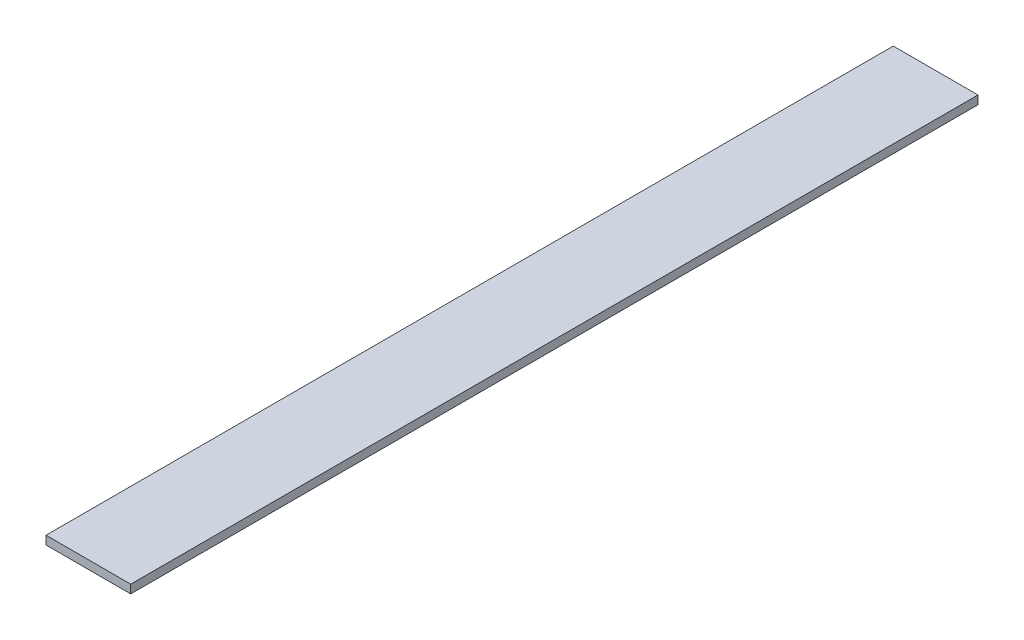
ISO-10303-21;
HEADER;
FILE_DESCRIPTION(('STEP AP214'),'2;1');
FILE_NAME('part.step','',(''),(''),'','','');
FILE_SCHEMA(('AUTOMOTIVE_DESIGN { 1 0 10303 214 1 1 1 1 }'));
ENDSEC;
DATA;
#1=APPLICATION_CONTEXT('core data for automotive mechanical design processes');
#2=APPLICATION_PROTOCOL_DEFINITION('international standard','automotive_design',2000,#1);
#3=PRODUCT_CONTEXT('',#1,'mechanical');
#4=PRODUCT('Part','Part','',(#3));
#5=PRODUCT_RELATED_PRODUCT_CATEGORY('part','',(#4));
#6=PRODUCT_DEFINITION_FORMATION('','',#4);
#7=PRODUCT_DEFINITION_CONTEXT('part definition',#1,'design');
#8=PRODUCT_DEFINITION('design','',#6,#7);
#9=PRODUCT_DEFINITION_SHAPE('','',#8);
#10=(LENGTH_UNIT() NAMED_UNIT(*) SI_UNIT(.MILLI.,.METRE.));
#11=(NAMED_UNIT(*) PLANE_ANGLE_UNIT() SI_UNIT($,.RADIAN.));
#12=(NAMED_UNIT(*) SI_UNIT($,.STERADIAN.) SOLID_ANGLE_UNIT());
#13=UNCERTAINTY_MEASURE_WITH_UNIT(LENGTH_MEASURE(1.E-05),#10,'distance_accuracy_value','');
#14=(GEOMETRIC_REPRESENTATION_CONTEXT(3) GLOBAL_UNCERTAINTY_ASSIGNED_CONTEXT((#13)) GLOBAL_UNIT_ASSIGNED_CONTEXT((#10,
#11,#12)) REPRESENTATION_CONTEXT('',''));
#15=CARTESIAN_POINT('',(0.,0.,0.));
#16=DIRECTION('',(0.,0.,1.));
#17=DIRECTION('',(1.,0.,0.));
#18=AXIS2_PLACEMENT_3D('',#15,#16,#17);
#19=CARTESIAN_POINT('',(-25.,5.,1900.));
#20=DIRECTION('',(1.,0.,0.));
#21=DIRECTION('',(0.,0.,-1.));
#22=AXIS2_PLACEMENT_3D('',#19,#20,#21);
#23=PLANE('',#22);
#24=DIRECTION('',(0.,-1.,0.));
#25=VECTOR('',#24,1.);
#26=CARTESIAN_POINT('',(-25.,5.,500.));
#27=LINE('',#26,#25);
#28=CARTESIAN_POINT('',(-25.,5.,500.));
#29=VERTEX_POINT('',#28);
#30=CARTESIAN_POINT('',(-25.,0.,500.));
#31=VERTEX_POINT('',#30);
#32=EDGE_CURVE('E54',#29,#31,#27,.T.);
#33=ORIENTED_EDGE('',*,*,#32,.F.);
#34=DIRECTION('',(0.,0.,-1.));
#35=VECTOR('',#34,1.);
#36=CARTESIAN_POINT('',(-25.,5.,1900.));
#37=LINE('',#36,#35);
#38=CARTESIAN_POINT('',(-25.,5.,0.));
#39=VERTEX_POINT('',#38);
#40=EDGE_CURVE('E36',#29,#39,#37,.T.);
#41=ORIENTED_EDGE('',*,*,#40,.T.);
#42=DIRECTION('',(0.,-1.,0.));
#43=VECTOR('',#42,1.);
#44=CARTESIAN_POINT('',(-25.,5.,0.));
#45=LINE('',#44,#43);
#46=CARTESIAN_POINT('',(-25.,0.,0.));
#47=VERTEX_POINT('',#46);
#48=EDGE_CURVE('E83',#39,#47,#45,.T.);
#49=ORIENTED_EDGE('',*,*,#48,.T.);
#50=DIRECTION('',(0.,0.,-1.));
#51=VECTOR('',#50,1.);
#52=CARTESIAN_POINT('',(-25.,0.,1900.));
#53=LINE('',#52,#51);
#54=EDGE_CURVE('E9',#31,#47,#53,.T.);
#55=ORIENTED_EDGE('',*,*,#54,.F.);
#56=EDGE_LOOP('',(#33,#41,#49,#55));
#57=FACE_BOUND('',#56,.T.);
#58=ADVANCED_FACE('F14',(#57),#23,.F.);
#59=CARTESIAN_POINT('',(-25.,0.,1900.));
#60=DIRECTION('',(0.,1.,0.));
#61=DIRECTION('',(-1.,0.,0.));
#62=AXIS2_PLACEMENT_3D('',#59,#60,#61);
#63=PLANE('',#62);
#64=DIRECTION('',(1.,0.,0.));
#65=VECTOR('',#64,1.);
#66=CARTESIAN_POINT('',(-25.,0.,500.));
#67=LINE('',#66,#65);
#68=CARTESIAN_POINT('',(25.,0.,500.));
#69=VERTEX_POINT('',#68);
#70=EDGE_CURVE('E60',#31,#69,#67,.T.);
#71=ORIENTED_EDGE('',*,*,#70,.F.);
#72=ORIENTED_EDGE('',*,*,#54,.T.);
#73=DIRECTION('',(1.,0.,0.));
#74=VECTOR('',#73,1.);
#75=CARTESIAN_POINT('',(-25.,0.,0.));
#76=LINE('',#75,#74);
#77=CARTESIAN_POINT('',(25.,0.,0.));
#78=VERTEX_POINT('',#77);
#79=EDGE_CURVE('E80',#47,#78,#76,.T.);
#80=ORIENTED_EDGE('',*,*,#79,.T.);
#81=DIRECTION('',(0.,0.,-1.));
#82=VECTOR('',#81,1.);
#83=CARTESIAN_POINT('',(25.,0.,1900.));
#84=LINE('',#83,#82);
#85=EDGE_CURVE('E21',#69,#78,#84,.T.);
#86=ORIENTED_EDGE('',*,*,#85,.F.);
#87=EDGE_LOOP('',(#71,#72,#80,#86));
#88=FACE_BOUND('',#87,.T.);
#89=ADVANCED_FACE('F81',(#88),#63,.F.);
#90=CARTESIAN_POINT('',(25.,5.,1900.));
#91=DIRECTION('',(-1.,0.,0.));
#92=DIRECTION('',(0.,0.,1.));
#93=AXIS2_PLACEMENT_3D('',#90,#91,#92);
#94=PLANE('',#93);
#95=DIRECTION('',(0.,1.,0.));
#96=VECTOR('',#95,1.);
#97=CARTESIAN_POINT('',(25.,0.,500.));
#98=LINE('',#97,#96);
#99=CARTESIAN_POINT('',(25.,5.,500.));
#100=VERTEX_POINT('',#99);
#101=EDGE_CURVE('E28',#69,#100,#98,.T.);
#102=ORIENTED_EDGE('',*,*,#101,.F.);
#103=ORIENTED_EDGE('',*,*,#85,.T.);
#104=DIRECTION('',(0.,1.,0.));
#105=VECTOR('',#104,1.);
#106=CARTESIAN_POINT('',(25.,5.,0.));
#107=LINE('',#106,#105);
#108=CARTESIAN_POINT('',(25.,5.,0.));
#109=VERTEX_POINT('',#108);
#110=EDGE_CURVE('E69',#78,#109,#107,.T.);
#111=ORIENTED_EDGE('',*,*,#110,.T.);
#112=DIRECTION('',(0.,0.,-1.));
#113=VECTOR('',#112,1.);
#114=CARTESIAN_POINT('',(25.,5.,1900.));
#115=LINE('',#114,#113);
#116=EDGE_CURVE('E66',#100,#109,#115,.T.);
#117=ORIENTED_EDGE('',*,*,#116,.F.);
#118=EDGE_LOOP('',(#102,#103,#111,#117));
#119=FACE_BOUND('',#118,.T.);
#120=ADVANCED_FACE('F76',(#119),#94,.F.);
#121=CARTESIAN_POINT('',(-25.,5.,1900.));
#122=DIRECTION('',(0.,-1.,0.));
#123=DIRECTION('',(0.,0.,-1.));
#124=AXIS2_PLACEMENT_3D('',#121,#122,#123);
#125=PLANE('',#124);
#126=DIRECTION('',(-1.,0.,0.));
#127=VECTOR('',#126,1.);
#128=CARTESIAN_POINT('',(25.,5.,500.));
#129=LINE('',#128,#127);
#130=EDGE_CURVE('E52',#100,#29,#129,.T.);
#131=ORIENTED_EDGE('',*,*,#130,.F.);
#132=ORIENTED_EDGE('',*,*,#116,.T.);
#133=DIRECTION('',(-1.,0.,0.));
#134=VECTOR('',#133,1.);
#135=CARTESIAN_POINT('',(-25.,5.,0.));
#136=LINE('',#135,#134);
#137=EDGE_CURVE('E64',#109,#39,#136,.T.);
#138=ORIENTED_EDGE('',*,*,#137,.T.);
#139=ORIENTED_EDGE('',*,*,#40,.F.);
#140=EDGE_LOOP('',(#131,#132,#138,#139));
#141=FACE_BOUND('',#140,.T.);
#142=ADVANCED_FACE('F62',(#141),#125,.F.);
#143=CARTESIAN_POINT('',(-25.,5.,0.));
#144=DIRECTION('',(0.,0.,1.));
#145=DIRECTION('',(1.,0.,0.));
#146=AXIS2_PLACEMENT_3D('',#143,#144,#145);
#147=PLANE('',#146);
#148=ORIENTED_EDGE('',*,*,#48,.F.);
#149=ORIENTED_EDGE('',*,*,#137,.F.);
#150=ORIENTED_EDGE('',*,*,#110,.F.);
#151=ORIENTED_EDGE('',*,*,#79,.F.);
#152=EDGE_LOOP('',(#148,#149,#150,#151));
#153=FACE_BOUND('',#152,.T.);
#154=ADVANCED_FACE('F85',(#153),#147,.F.);
#155=CARTESIAN_POINT('',(-25.,5.,500.));
#156=DIRECTION('',(0.,0.,1.));
#157=DIRECTION('',(1.,0.,0.));
#158=AXIS2_PLACEMENT_3D('',#155,#156,#157);
#159=PLANE('',#158);
#160=ORIENTED_EDGE('',*,*,#130,.T.);
#161=ORIENTED_EDGE('',*,*,#32,.T.);
#162=ORIENTED_EDGE('',*,*,#70,.T.);
#163=ORIENTED_EDGE('',*,*,#101,.T.);
#164=EDGE_LOOP('',(#160,#161,#162,#163));
#165=FACE_BOUND('',#164,.T.);
#166=ADVANCED_FACE('F53',(#165),#159,.T.);
#167=CLOSED_SHELL('',(#58,#89,#120,#142,#154,#166));
#168=MANIFOLD_SOLID_BREP('B1',#167);
#169=ADVANCED_BREP_SHAPE_REPRESENTATION('',(#18,#168),#14);
#170=SHAPE_DEFINITION_REPRESENTATION(#9,#169);
ENDSEC;
END-ISO-10303-21;
